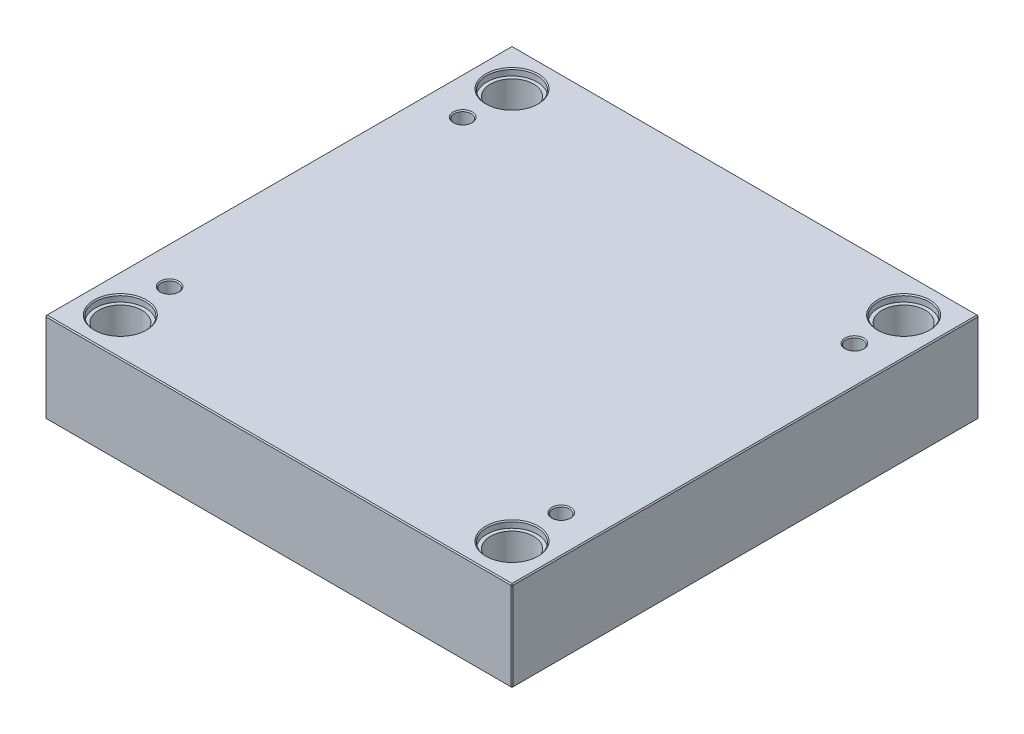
ISO-10303-21;
HEADER;
FILE_DESCRIPTION(('STEP AP214'),'2;1');
FILE_NAME('part.step','',(''),(''),'','','');
FILE_SCHEMA(('AUTOMOTIVE_DESIGN { 1 0 10303 214 1 1 1 1 }'));
ENDSEC;
DATA;
#1=APPLICATION_CONTEXT('core data for automotive mechanical design processes');
#2=APPLICATION_PROTOCOL_DEFINITION('international standard','automotive_design',2000,#1);
#3=PRODUCT_CONTEXT('',#1,'mechanical');
#4=PRODUCT('Part','Part','',(#3));
#5=PRODUCT_RELATED_PRODUCT_CATEGORY('part','',(#4));
#6=PRODUCT_DEFINITION_FORMATION('','',#4);
#7=PRODUCT_DEFINITION_CONTEXT('part definition',#1,'design');
#8=PRODUCT_DEFINITION('design','',#6,#7);
#9=PRODUCT_DEFINITION_SHAPE('','',#8);
#10=(LENGTH_UNIT() NAMED_UNIT(*) SI_UNIT(.MILLI.,.METRE.));
#11=(NAMED_UNIT(*) PLANE_ANGLE_UNIT() SI_UNIT($,.RADIAN.));
#12=(NAMED_UNIT(*) SI_UNIT($,.STERADIAN.) SOLID_ANGLE_UNIT());
#13=UNCERTAINTY_MEASURE_WITH_UNIT(LENGTH_MEASURE(1.E-05),#10,'distance_accuracy_value','');
#14=(GEOMETRIC_REPRESENTATION_CONTEXT(3) GLOBAL_UNCERTAINTY_ASSIGNED_CONTEXT((#13)) GLOBAL_UNIT_ASSIGNED_CONTEXT((#10,
#11,#12)) REPRESENTATION_CONTEXT('',''));
#15=CARTESIAN_POINT('',(0.,0.,0.));
#16=DIRECTION('',(0.,0.,1.));
#17=DIRECTION('',(1.,0.,0.));
#18=AXIS2_PLACEMENT_3D('',#15,#16,#17);
#19=CARTESIAN_POINT('',(-187.,0.,-187.));
#20=DIRECTION('',(0.,1.,0.));
#21=DIRECTION('',(0.,0.,1.));
#22=AXIS2_PLACEMENT_3D('',#19,#20,#21);
#23=CYLINDRICAL_SURFACE('',#22,20.65);
#24=CARTESIAN_POINT('',(-187.,0.99999999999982,-187.));
#25=DIRECTION('',(0.,1.,0.));
#26=DIRECTION('',(0.,0.,1.));
#27=AXIS2_PLACEMENT_3D('',#24,#25,#26);
#28=CIRCLE('',#27,20.65);
#29=CARTESIAN_POINT('',(-187.,0.99999999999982,-166.35));
#30=VERTEX_POINT('',#29);
#31=EDGE_CURVE('E472',#30,#30,#28,.F.);
#32=ORIENTED_EDGE('',*,*,#31,.T.);
#33=EDGE_LOOP('',(#32));
#34=FACE_BOUND('',#33,.T.);
#35=CARTESIAN_POINT('',(-187.,79.7,-187.));
#36=DIRECTION('',(0.,1.,0.));
#37=DIRECTION('',(0.,0.,1.));
#38=AXIS2_PLACEMENT_3D('',#35,#36,#37);
#39=CIRCLE('',#38,20.65);
#40=CARTESIAN_POINT('',(-187.,79.7,-166.35));
#41=VERTEX_POINT('',#40);
#42=EDGE_CURVE('E221',#41,#41,#39,.F.);
#43=ORIENTED_EDGE('',*,*,#42,.F.);
#44=EDGE_LOOP('',(#43));
#45=FACE_BOUND('',#44,.T.);
#46=ADVANCED_FACE('F16',(#34,#45),#23,.F.);
#47=CARTESIAN_POINT('',(187.,0.,-187.));
#48=DIRECTION('',(0.,1.,0.));
#49=DIRECTION('',(0.,0.,1.));
#50=AXIS2_PLACEMENT_3D('',#47,#48,#49);
#51=CYLINDRICAL_SURFACE('',#50,20.65);
#52=CARTESIAN_POINT('',(187.,0.99999999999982,-187.));
#53=DIRECTION('',(0.,1.,0.));
#54=DIRECTION('',(0.,0.,1.));
#55=AXIS2_PLACEMENT_3D('',#52,#53,#54);
#56=CIRCLE('',#55,20.65);
#57=CARTESIAN_POINT('',(187.,0.99999999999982,-166.35));
#58=VERTEX_POINT('',#57);
#59=EDGE_CURVE('E474',#58,#58,#56,.F.);
#60=ORIENTED_EDGE('',*,*,#59,.T.);
#61=EDGE_LOOP('',(#60));
#62=FACE_BOUND('',#61,.T.);
#63=CARTESIAN_POINT('',(187.,79.7,-187.));
#64=DIRECTION('',(0.,1.,0.));
#65=DIRECTION('',(0.,0.,1.));
#66=AXIS2_PLACEMENT_3D('',#63,#64,#65);
#67=CIRCLE('',#66,20.65);
#68=CARTESIAN_POINT('',(187.,79.7,-166.35));
#69=VERTEX_POINT('',#68);
#70=EDGE_CURVE('E218',#69,#69,#67,.F.);
#71=ORIENTED_EDGE('',*,*,#70,.F.);
#72=EDGE_LOOP('',(#71));
#73=FACE_BOUND('',#72,.T.);
#74=ADVANCED_FACE('F263',(#62,#73),#51,.F.);
#75=CARTESIAN_POINT('',(187.,0.,187.));
#76=DIRECTION('',(0.,1.,0.));
#77=DIRECTION('',(0.,0.,1.));
#78=AXIS2_PLACEMENT_3D('',#75,#76,#77);
#79=CYLINDRICAL_SURFACE('',#78,20.65);
#80=CARTESIAN_POINT('',(187.,0.999999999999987,187.));
#81=DIRECTION('',(0.,1.,0.));
#82=DIRECTION('',(0.,0.,1.));
#83=AXIS2_PLACEMENT_3D('',#80,#81,#82);
#84=CIRCLE('',#83,20.65);
#85=CARTESIAN_POINT('',(187.,0.999999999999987,207.65));
#86=VERTEX_POINT('',#85);
#87=EDGE_CURVE('E477',#86,#86,#84,.F.);
#88=ORIENTED_EDGE('',*,*,#87,.T.);
#89=EDGE_LOOP('',(#88));
#90=FACE_BOUND('',#89,.T.);
#91=CARTESIAN_POINT('',(187.,79.7,187.));
#92=DIRECTION('',(0.,1.,0.));
#93=DIRECTION('',(0.,0.,1.));
#94=AXIS2_PLACEMENT_3D('',#91,#92,#93);
#95=CIRCLE('',#94,20.65);
#96=CARTESIAN_POINT('',(187.,79.7,207.65));
#97=VERTEX_POINT('',#96);
#98=EDGE_CURVE('E214',#97,#97,#95,.F.);
#99=ORIENTED_EDGE('',*,*,#98,.F.);
#100=EDGE_LOOP('',(#99));
#101=FACE_BOUND('',#100,.T.);
#102=ADVANCED_FACE('F270',(#90,#101),#79,.F.);
#103=CARTESIAN_POINT('',(-187.,0.,187.));
#104=DIRECTION('',(0.,1.,0.));
#105=DIRECTION('',(0.,0.,1.));
#106=AXIS2_PLACEMENT_3D('',#103,#104,#105);
#107=CYLINDRICAL_SURFACE('',#106,20.65);
#108=CARTESIAN_POINT('',(-187.,0.999999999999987,187.));
#109=DIRECTION('',(0.,1.,0.));
#110=DIRECTION('',(0.,0.,1.));
#111=AXIS2_PLACEMENT_3D('',#108,#109,#110);
#112=CIRCLE('',#111,20.65);
#113=CARTESIAN_POINT('',(-187.,0.999999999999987,207.65));
#114=VERTEX_POINT('',#113);
#115=EDGE_CURVE('E480',#114,#114,#112,.F.);
#116=ORIENTED_EDGE('',*,*,#115,.T.);
#117=EDGE_LOOP('',(#116));
#118=FACE_BOUND('',#117,.T.);
#119=CARTESIAN_POINT('',(-187.,79.7,187.));
#120=DIRECTION('',(0.,1.,0.));
#121=DIRECTION('',(0.,0.,1.));
#122=AXIS2_PLACEMENT_3D('',#119,#120,#121);
#123=CIRCLE('',#122,20.65);
#124=CARTESIAN_POINT('',(-187.,79.7,207.65));
#125=VERTEX_POINT('',#124);
#126=EDGE_CURVE('E211',#125,#125,#123,.F.);
#127=ORIENTED_EDGE('',*,*,#126,.F.);
#128=EDGE_LOOP('',(#127));
#129=FACE_BOUND('',#128,.T.);
#130=ADVANCED_FACE('F277',(#118,#129),#107,.F.);
#131=CARTESIAN_POINT('',(-223.,86.,223.));
#132=DIRECTION('',(1.,0.,0.));
#133=DIRECTION('',(0.,0.,-1.));
#134=AXIS2_PLACEMENT_3D('',#131,#132,#133);
#135=PLANE('',#134);
#136=DIRECTION('',(0.,-1.,0.));
#137=VECTOR('',#136,1.);
#138=CARTESIAN_POINT('',(-223.,86.,-222.));
#139=LINE('',#138,#137);
#140=CARTESIAN_POINT('',(-223.,85.,-222.));
#141=VERTEX_POINT('',#140);
#142=CARTESIAN_POINT('',(-223.,0.99999999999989,-222.));
#143=VERTEX_POINT('',#142);
#144=EDGE_CURVE('E487',#141,#143,#139,.T.);
#145=ORIENTED_EDGE('',*,*,#144,.T.);
#146=DIRECTION('',(0.,0.,1.));
#147=VECTOR('',#146,1.);
#148=CARTESIAN_POINT('',(-223.,0.99999999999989,223.));
#149=LINE('',#148,#147);
#150=CARTESIAN_POINT('',(-223.,0.99999999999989,222.));
#151=VERTEX_POINT('',#150);
#152=EDGE_CURVE('E490',#143,#151,#149,.T.);
#153=ORIENTED_EDGE('',*,*,#152,.T.);
#154=DIRECTION('',(0.,1.,0.));
#155=VECTOR('',#154,1.);
#156=CARTESIAN_POINT('',(-223.,86.,222.));
#157=LINE('',#156,#155);
#158=CARTESIAN_POINT('',(-223.,85.,222.));
#159=VERTEX_POINT('',#158);
#160=EDGE_CURVE('E485',#151,#159,#157,.T.);
#161=ORIENTED_EDGE('',*,*,#160,.T.);
#162=DIRECTION('',(0.,0.,-1.));
#163=VECTOR('',#162,1.);
#164=CARTESIAN_POINT('',(-223.,85.,-223.));
#165=LINE('',#164,#163);
#166=EDGE_CURVE('E483',#159,#141,#165,.T.);
#167=ORIENTED_EDGE('',*,*,#166,.T.);
#168=EDGE_LOOP('',(#145,#153,#161,#167));
#169=FACE_BOUND('',#168,.T.);
#170=ADVANCED_FACE('F298',(#169),#135,.F.);
#171=CARTESIAN_POINT('',(223.,86.,223.));
#172=DIRECTION('',(0.,0.,-1.));
#173=DIRECTION('',(-1.,0.,0.));
#174=AXIS2_PLACEMENT_3D('',#171,#172,#173);
#175=PLANE('',#174);
#176=DIRECTION('',(-1.,0.,0.));
#177=VECTOR('',#176,1.);
#178=CARTESIAN_POINT('',(-223.,85.,223.));
#179=LINE('',#178,#177);
#180=CARTESIAN_POINT('',(222.,85.,223.));
#181=VERTEX_POINT('',#180);
#182=CARTESIAN_POINT('',(-222.,85.,223.));
#183=VERTEX_POINT('',#182);
#184=EDGE_CURVE('E509',#181,#183,#179,.T.);
#185=ORIENTED_EDGE('',*,*,#184,.T.);
#186=DIRECTION('',(0.,-1.,0.));
#187=VECTOR('',#186,1.);
#188=CARTESIAN_POINT('',(-222.,86.,223.));
#189=LINE('',#188,#187);
#190=CARTESIAN_POINT('',(-222.,0.99999999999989,223.));
#191=VERTEX_POINT('',#190);
#192=EDGE_CURVE('E515',#183,#191,#189,.T.);
#193=ORIENTED_EDGE('',*,*,#192,.T.);
#194=DIRECTION('',(1.,0.,0.));
#195=VECTOR('',#194,1.);
#196=CARTESIAN_POINT('',(223.,0.99999999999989,223.));
#197=LINE('',#196,#195);
#198=CARTESIAN_POINT('',(222.,0.99999999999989,223.));
#199=VERTEX_POINT('',#198);
#200=EDGE_CURVE('E513',#191,#199,#197,.T.);
#201=ORIENTED_EDGE('',*,*,#200,.T.);
#202=DIRECTION('',(0.,1.,0.));
#203=VECTOR('',#202,1.);
#204=CARTESIAN_POINT('',(222.,86.,223.));
#205=LINE('',#204,#203);
#206=EDGE_CURVE('E511',#199,#181,#205,.T.);
#207=ORIENTED_EDGE('',*,*,#206,.T.);
#208=EDGE_LOOP('',(#185,#193,#201,#207));
#209=FACE_BOUND('',#208,.T.);
#210=ADVANCED_FACE('F294',(#209),#175,.F.);
#211=CARTESIAN_POINT('',(223.,86.,223.));
#212=DIRECTION('',(-1.,0.,0.));
#213=DIRECTION('',(0.,0.,1.));
#214=AXIS2_PLACEMENT_3D('',#211,#212,#213);
#215=PLANE('',#214);
#216=DIRECTION('',(0.,0.,-1.));
#217=VECTOR('',#216,1.);
#218=CARTESIAN_POINT('',(223.,0.99999999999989,223.));
#219=LINE('',#218,#217);
#220=CARTESIAN_POINT('',(223.,0.99999999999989,222.));
#221=VERTEX_POINT('',#220);
#222=CARTESIAN_POINT('',(223.,0.99999999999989,-222.));
#223=VERTEX_POINT('',#222);
#224=EDGE_CURVE('E504',#221,#223,#219,.T.);
#225=ORIENTED_EDGE('',*,*,#224,.T.);
#226=DIRECTION('',(0.,1.,0.));
#227=VECTOR('',#226,1.);
#228=CARTESIAN_POINT('',(223.,86.,-222.));
#229=LINE('',#228,#227);
#230=CARTESIAN_POINT('',(223.,85.,-222.));
#231=VERTEX_POINT('',#230);
#232=EDGE_CURVE('E506',#223,#231,#229,.T.);
#233=ORIENTED_EDGE('',*,*,#232,.T.);
#234=DIRECTION('',(0.,0.,1.));
#235=VECTOR('',#234,1.);
#236=CARTESIAN_POINT('',(223.,85.,223.));
#237=LINE('',#236,#235);
#238=CARTESIAN_POINT('',(223.,85.,222.));
#239=VERTEX_POINT('',#238);
#240=EDGE_CURVE('E500',#231,#239,#237,.T.);
#241=ORIENTED_EDGE('',*,*,#240,.T.);
#242=DIRECTION('',(0.,-1.,0.));
#243=VECTOR('',#242,1.);
#244=CARTESIAN_POINT('',(223.,86.,222.));
#245=LINE('',#244,#243);
#246=EDGE_CURVE('E502',#239,#221,#245,.T.);
#247=ORIENTED_EDGE('',*,*,#246,.T.);
#248=EDGE_LOOP('',(#225,#233,#241,#247));
#249=FACE_BOUND('',#248,.T.);
#250=ADVANCED_FACE('F290',(#249),#215,.F.);
#251=CARTESIAN_POINT('',(223.,86.,-223.));
#252=DIRECTION('',(0.,0.,1.));
#253=DIRECTION('',(1.,0.,0.));
#254=AXIS2_PLACEMENT_3D('',#251,#252,#253);
#255=PLANE('',#254);
#256=DIRECTION('',(0.,-1.,0.));
#257=VECTOR('',#256,1.);
#258=CARTESIAN_POINT('',(222.,86.,-223.));
#259=LINE('',#258,#257);
#260=CARTESIAN_POINT('',(222.,85.,-223.));
#261=VERTEX_POINT('',#260);
#262=CARTESIAN_POINT('',(222.,0.99999999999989,-223.));
#263=VERTEX_POINT('',#262);
#264=EDGE_CURVE('E494',#261,#263,#259,.T.);
#265=ORIENTED_EDGE('',*,*,#264,.T.);
#266=DIRECTION('',(-1.,0.,0.));
#267=VECTOR('',#266,1.);
#268=CARTESIAN_POINT('',(223.,0.99999999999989,-223.));
#269=LINE('',#268,#267);
#270=CARTESIAN_POINT('',(-222.,0.99999999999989,-223.));
#271=VERTEX_POINT('',#270);
#272=EDGE_CURVE('E138',#263,#271,#269,.T.);
#273=ORIENTED_EDGE('',*,*,#272,.T.);
#274=DIRECTION('',(0.,1.,0.));
#275=VECTOR('',#274,1.);
#276=CARTESIAN_POINT('',(-222.,86.,-223.));
#277=LINE('',#276,#275);
#278=CARTESIAN_POINT('',(-222.,85.,-223.));
#279=VERTEX_POINT('',#278);
#280=EDGE_CURVE('E496',#271,#279,#277,.T.);
#281=ORIENTED_EDGE('',*,*,#280,.T.);
#282=DIRECTION('',(1.,0.,0.));
#283=VECTOR('',#282,1.);
#284=CARTESIAN_POINT('',(223.,85.,-223.));
#285=LINE('',#284,#283);
#286=EDGE_CURVE('E492',#279,#261,#285,.T.);
#287=ORIENTED_EDGE('',*,*,#286,.T.);
#288=EDGE_LOOP('',(#265,#273,#281,#287));
#289=FACE_BOUND('',#288,.T.);
#290=ADVANCED_FACE('F282',(#289),#255,.F.);
#291=CARTESIAN_POINT('',(0.,86.,0.));
#292=DIRECTION('',(0.,1.,0.));
#293=DIRECTION('',(0.,0.,1.));
#294=AXIS2_PLACEMENT_3D('',#291,#292,#293);
#295=PLANE('',#294);
#296=CARTESIAN_POINT('',(187.,86.,187.));
#297=DIRECTION('',(0.,1.,0.));
#298=DIRECTION('',(0.,0.,1.));
#299=AXIS2_PLACEMENT_3D('',#296,#297,#298);
#300=CIRCLE('',#299,25.);
#301=CARTESIAN_POINT('',(187.,86.,212.));
#302=VERTEX_POINT('',#301);
#303=EDGE_CURVE('E236',#302,#302,#300,.F.);
#304=ORIENTED_EDGE('',*,*,#303,.T.);
#305=EDGE_LOOP('',(#304));
#306=FACE_BOUND('',#305,.T.);
#307=CARTESIAN_POINT('',(-187.,86.,187.));
#308=DIRECTION('',(0.,1.,0.));
#309=DIRECTION('',(0.,0.,1.));
#310=AXIS2_PLACEMENT_3D('',#307,#308,#309);
#311=CIRCLE('',#310,25.);
#312=CARTESIAN_POINT('',(-187.,86.,212.));
#313=VERTEX_POINT('',#312);
#314=EDGE_CURVE('E233',#313,#313,#311,.F.);
#315=ORIENTED_EDGE('',*,*,#314,.T.);
#316=EDGE_LOOP('',(#315));
#317=FACE_BOUND('',#316,.T.);
#318=CARTESIAN_POINT('',(187.,86.,-187.));
#319=DIRECTION('',(0.,1.,0.));
#320=DIRECTION('',(0.,0.,1.));
#321=AXIS2_PLACEMENT_3D('',#318,#319,#320);
#322=CIRCLE('',#321,25.);
#323=CARTESIAN_POINT('',(187.,86.,-162.));
#324=VERTEX_POINT('',#323);
#325=EDGE_CURVE('E230',#324,#324,#322,.F.);
#326=ORIENTED_EDGE('',*,*,#325,.T.);
#327=EDGE_LOOP('',(#326));
#328=FACE_BOUND('',#327,.T.);
#329=CARTESIAN_POINT('',(-187.,86.,-187.));
#330=DIRECTION('',(0.,1.,0.));
#331=DIRECTION('',(0.,0.,1.));
#332=AXIS2_PLACEMENT_3D('',#329,#330,#331);
#333=CIRCLE('',#332,25.);
#334=CARTESIAN_POINT('',(-187.,86.,-162.));
#335=VERTEX_POINT('',#334);
#336=EDGE_CURVE('E227',#335,#335,#333,.F.);
#337=ORIENTED_EDGE('',*,*,#336,.T.);
#338=EDGE_LOOP('',(#337));
#339=FACE_BOUND('',#338,.T.);
#340=CARTESIAN_POINT('',(-187.,86.,140.));
#341=DIRECTION('',(0.,1.,0.));
#342=DIRECTION('',(0.,0.,1.));
#343=AXIS2_PLACEMENT_3D('',#340,#341,#342);
#344=CIRCLE('',#343,8.99999999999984);
#345=CARTESIAN_POINT('',(-187.,86.,149.));
#346=VERTEX_POINT('',#345);
#347=EDGE_CURVE('E198',#346,#346,#344,.F.);
#348=ORIENTED_EDGE('',*,*,#347,.T.);
#349=EDGE_LOOP('',(#348));
#350=FACE_BOUND('',#349,.T.);
#351=CARTESIAN_POINT('',(187.,86.,140.));
#352=DIRECTION('',(0.,1.,0.));
#353=DIRECTION('',(0.,0.,1.));
#354=AXIS2_PLACEMENT_3D('',#351,#352,#353);
#355=CIRCLE('',#354,9.);
#356=CARTESIAN_POINT('',(187.,86.,149.));
#357=VERTEX_POINT('',#356);
#358=EDGE_CURVE('E195',#357,#357,#355,.F.);
#359=ORIENTED_EDGE('',*,*,#358,.T.);
#360=EDGE_LOOP('',(#359));
#361=FACE_BOUND('',#360,.T.);
#362=CARTESIAN_POINT('',(187.,86.,-140.));
#363=DIRECTION('',(0.,1.,0.));
#364=DIRECTION('',(0.,0.,1.));
#365=AXIS2_PLACEMENT_3D('',#362,#363,#364);
#366=CIRCLE('',#365,9.);
#367=CARTESIAN_POINT('',(187.,86.,-131.));
#368=VERTEX_POINT('',#367);
#369=EDGE_CURVE('E192',#368,#368,#366,.F.);
#370=ORIENTED_EDGE('',*,*,#369,.T.);
#371=EDGE_LOOP('',(#370));
#372=FACE_BOUND('',#371,.T.);
#373=CARTESIAN_POINT('',(-187.,86.,-140.));
#374=DIRECTION('',(0.,1.,0.));
#375=DIRECTION('',(0.,0.,1.));
#376=AXIS2_PLACEMENT_3D('',#373,#374,#375);
#377=CIRCLE('',#376,8.99999999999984);
#378=CARTESIAN_POINT('',(-187.,86.,-131.));
#379=VERTEX_POINT('',#378);
#380=EDGE_CURVE('E188',#379,#379,#377,.F.);
#381=ORIENTED_EDGE('',*,*,#380,.T.);
#382=EDGE_LOOP('',(#381));
#383=FACE_BOUND('',#382,.T.);
#384=DIRECTION('',(0.,0.,-1.));
#385=VECTOR('',#384,1.);
#386=CARTESIAN_POINT('',(222.,86.,-223.));
#387=LINE('',#386,#385);
#388=CARTESIAN_POINT('',(222.,86.,222.));
#389=VERTEX_POINT('',#388);
#390=CARTESIAN_POINT('',(222.,86.,-222.));
#391=VERTEX_POINT('',#390);
#392=EDGE_CURVE('E31',#389,#391,#387,.T.);
#393=ORIENTED_EDGE('',*,*,#392,.T.);
#394=DIRECTION('',(-1.,0.,0.));
#395=VECTOR('',#394,1.);
#396=CARTESIAN_POINT('',(-223.,86.,-222.));
#397=LINE('',#396,#395);
#398=CARTESIAN_POINT('',(-222.,86.,-222.));
#399=VERTEX_POINT('',#398);
#400=EDGE_CURVE('E189',#391,#399,#397,.T.);
#401=ORIENTED_EDGE('',*,*,#400,.T.);
#402=DIRECTION('',(0.,0.,1.));
#403=VECTOR('',#402,1.);
#404=CARTESIAN_POINT('',(-222.,86.,223.));
#405=LINE('',#404,#403);
#406=CARTESIAN_POINT('',(-222.,86.,222.));
#407=VERTEX_POINT('',#406);
#408=EDGE_CURVE('E518',#399,#407,#405,.T.);
#409=ORIENTED_EDGE('',*,*,#408,.T.);
#410=DIRECTION('',(1.,0.,0.));
#411=VECTOR('',#410,1.);
#412=CARTESIAN_POINT('',(223.,86.,222.));
#413=LINE('',#412,#411);
#414=EDGE_CURVE('E36',#407,#389,#413,.T.);
#415=ORIENTED_EDGE('',*,*,#414,.T.);
#416=EDGE_LOOP('',(#393,#401,#409,#415));
#417=FACE_BOUND('',#416,.T.);
#418=ADVANCED_FACE('F279',(#306,#317,#328,#339,#350,#361,#372,#383,#417),#295,.T.);
#419=CARTESIAN_POINT('',(0.,0.,0.));
#420=DIRECTION('',(0.,1.,0.));
#421=DIRECTION('',(0.,0.,1.));
#422=AXIS2_PLACEMENT_3D('',#419,#420,#421);
#423=PLANE('',#422);
#424=CARTESIAN_POINT('',(-187.,0.,-187.));
#425=DIRECTION('',(0.,1.,0.));
#426=DIRECTION('',(0.,0.,1.));
#427=AXIS2_PLACEMENT_3D('',#424,#425,#426);
#428=CIRCLE('',#427,21.65);
#429=CARTESIAN_POINT('',(-187.,0.,-165.35));
#430=VERTEX_POINT('',#429);
#431=EDGE_CURVE('E469',#430,#430,#428,.T.);
#432=ORIENTED_EDGE('',*,*,#431,.T.);
#433=EDGE_LOOP('',(#432));
#434=FACE_BOUND('',#433,.T.);
#435=CARTESIAN_POINT('',(187.,0.,-187.));
#436=DIRECTION('',(0.,1.,0.));
#437=DIRECTION('',(0.,0.,1.));
#438=AXIS2_PLACEMENT_3D('',#435,#436,#437);
#439=CIRCLE('',#438,21.65);
#440=CARTESIAN_POINT('',(187.,0.,-165.35));
#441=VERTEX_POINT('',#440);
#442=EDGE_CURVE('E466',#441,#441,#439,.T.);
#443=ORIENTED_EDGE('',*,*,#442,.T.);
#444=EDGE_LOOP('',(#443));
#445=FACE_BOUND('',#444,.T.);
#446=CARTESIAN_POINT('',(187.,0.,187.));
#447=DIRECTION('',(0.,1.,0.));
#448=DIRECTION('',(0.,0.,1.));
#449=AXIS2_PLACEMENT_3D('',#446,#447,#448);
#450=CIRCLE('',#449,21.65);
#451=CARTESIAN_POINT('',(187.,0.,208.65));
#452=VERTEX_POINT('',#451);
#453=EDGE_CURVE('E463',#452,#452,#450,.T.);
#454=ORIENTED_EDGE('',*,*,#453,.T.);
#455=EDGE_LOOP('',(#454));
#456=FACE_BOUND('',#455,.T.);
#457=CARTESIAN_POINT('',(-187.,0.,187.));
#458=DIRECTION('',(0.,1.,0.));
#459=DIRECTION('',(0.,0.,1.));
#460=AXIS2_PLACEMENT_3D('',#457,#458,#459);
#461=CIRCLE('',#460,21.65);
#462=CARTESIAN_POINT('',(-187.,0.,208.65));
#463=VERTEX_POINT('',#462);
#464=EDGE_CURVE('E460',#463,#463,#461,.T.);
#465=ORIENTED_EDGE('',*,*,#464,.T.);
#466=EDGE_LOOP('',(#465));
#467=FACE_BOUND('',#466,.T.);
#468=DIRECTION('',(0.,0.,1.));
#469=VECTOR('',#468,1.);
#470=CARTESIAN_POINT('',(222.,0.,0.));
#471=LINE('',#470,#469);
#472=CARTESIAN_POINT('',(222.,0.,-222.));
#473=VERTEX_POINT('',#472);
#474=CARTESIAN_POINT('',(222.,0.,222.));
#475=VERTEX_POINT('',#474);
#476=EDGE_CURVE('E108',#473,#475,#471,.T.);
#477=ORIENTED_EDGE('',*,*,#476,.T.);
#478=DIRECTION('',(-1.,0.,0.));
#479=VECTOR('',#478,1.);
#480=CARTESIAN_POINT('',(0.,0.,222.));
#481=LINE('',#480,#479);
#482=CARTESIAN_POINT('',(-222.,0.,222.));
#483=VERTEX_POINT('',#482);
#484=EDGE_CURVE('E458',#475,#483,#481,.T.);
#485=ORIENTED_EDGE('',*,*,#484,.T.);
#486=DIRECTION('',(0.,0.,-1.));
#487=VECTOR('',#486,1.);
#488=CARTESIAN_POINT('',(-222.,0.,0.));
#489=LINE('',#488,#487);
#490=CARTESIAN_POINT('',(-222.,0.,-222.));
#491=VERTEX_POINT('',#490);
#492=EDGE_CURVE('E110',#483,#491,#489,.T.);
#493=ORIENTED_EDGE('',*,*,#492,.T.);
#494=DIRECTION('',(1.,0.,0.));
#495=VECTOR('',#494,1.);
#496=CARTESIAN_POINT('',(0.,0.,-222.));
#497=LINE('',#496,#495);
#498=EDGE_CURVE('E104',#491,#473,#497,.T.);
#499=ORIENTED_EDGE('',*,*,#498,.T.);
#500=EDGE_LOOP('',(#477,#485,#493,#499));
#501=FACE_BOUND('',#500,.T.);
#502=ADVANCED_FACE('F106',(#434,#445,#456,#467,#501),#423,.F.);
#503=CARTESIAN_POINT('',(-187.,0.,-187.));
#504=DIRECTION('',(0.,-1.,0.));
#505=DIRECTION('',(0.,0.,-1.));
#506=AXIS2_PLACEMENT_3D('',#503,#504,#505);
#507=CONICAL_SURFACE('',#506,21.65,0.785398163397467);
#508=ORIENTED_EDGE('',*,*,#31,.F.);
#509=EDGE_LOOP('',(#508));
#510=FACE_BOUND('',#509,.T.);
#511=ORIENTED_EDGE('',*,*,#431,.F.);
#512=EDGE_LOOP('',(#511));
#513=FACE_BOUND('',#512,.T.);
#514=ADVANCED_FACE('F286',(#510,#513),#507,.F.);
#515=CARTESIAN_POINT('',(187.,0.,-187.));
#516=DIRECTION('',(0.,-1.,0.));
#517=DIRECTION('',(0.,0.,-1.));
#518=AXIS2_PLACEMENT_3D('',#515,#516,#517);
#519=CONICAL_SURFACE('',#518,21.65,0.785398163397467);
#520=ORIENTED_EDGE('',*,*,#59,.F.);
#521=EDGE_LOOP('',(#520));
#522=FACE_BOUND('',#521,.T.);
#523=ORIENTED_EDGE('',*,*,#442,.F.);
#524=EDGE_LOOP('',(#523));
#525=FACE_BOUND('',#524,.T.);
#526=ADVANCED_FACE('F305',(#522,#525),#519,.F.);
#527=CARTESIAN_POINT('',(187.,0.,187.));
#528=DIRECTION('',(0.,-1.,0.));
#529=DIRECTION('',(0.,0.,-1.));
#530=AXIS2_PLACEMENT_3D('',#527,#528,#529);
#531=CONICAL_SURFACE('',#530,21.65,0.785398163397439);
#532=ORIENTED_EDGE('',*,*,#87,.F.);
#533=EDGE_LOOP('',(#532));
#534=FACE_BOUND('',#533,.T.);
#535=ORIENTED_EDGE('',*,*,#453,.F.);
#536=EDGE_LOOP('',(#535));
#537=FACE_BOUND('',#536,.T.);
#538=ADVANCED_FACE('F309',(#534,#537),#531,.F.);
#539=CARTESIAN_POINT('',(-187.,0.,187.));
#540=DIRECTION('',(0.,-1.,0.));
#541=DIRECTION('',(0.,0.,-1.));
#542=AXIS2_PLACEMENT_3D('',#539,#540,#541);
#543=CONICAL_SURFACE('',#542,21.65,0.785398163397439);
#544=ORIENTED_EDGE('',*,*,#115,.F.);
#545=EDGE_LOOP('',(#544));
#546=FACE_BOUND('',#545,.T.);
#547=ORIENTED_EDGE('',*,*,#464,.F.);
#548=EDGE_LOOP('',(#547));
#549=FACE_BOUND('',#548,.T.);
#550=ADVANCED_FACE('F313',(#546,#549),#543,.F.);
#551=CARTESIAN_POINT('',(223.,86.,222.));
#552=DIRECTION('',(-0.707106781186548,0.,-0.707106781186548));
#553=DIRECTION('',(0.,-1.,0.));
#554=AXIS2_PLACEMENT_3D('',#551,#552,#553);
#555=PLANE('',#554);
#556=DIRECTION('',(-0.707106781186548,0.,0.707106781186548));
#557=VECTOR('',#556,1.);
#558=CARTESIAN_POINT('',(222.,85.,223.));
#559=LINE('',#558,#557);
#560=EDGE_CURVE('E126',#181,#239,#559,.F.);
#561=ORIENTED_EDGE('',*,*,#560,.F.);
#562=ORIENTED_EDGE('',*,*,#206,.F.);
#563=DIRECTION('',(0.707106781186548,0.,-0.707106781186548));
#564=VECTOR('',#563,1.);
#565=CARTESIAN_POINT('',(222.,0.99999999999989,223.));
#566=LINE('',#565,#564);
#567=EDGE_CURVE('E180',#221,#199,#566,.F.);
#568=ORIENTED_EDGE('',*,*,#567,.F.);
#569=ORIENTED_EDGE('',*,*,#246,.F.);
#570=EDGE_LOOP('',(#561,#562,#568,#569));
#571=FACE_BOUND('',#570,.T.);
#572=ADVANCED_FACE('F317',(#571),#555,.F.);
#573=CARTESIAN_POINT('',(222.,85.,223.));
#574=DIRECTION('',(0.577350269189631,0.577350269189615,0.577350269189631));
#575=DIRECTION('',(0.707106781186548,0.,-0.707106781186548));
#576=AXIS2_PLACEMENT_3D('',#573,#574,#575);
#577=PLANE('',#576);
#578=DIRECTION('',(0.,-0.707106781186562,0.707106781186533));
#579=VECTOR('',#578,1.);
#580=CARTESIAN_POINT('',(222.,85.,223.));
#581=LINE('',#580,#579);
#582=EDGE_CURVE('E175',#181,#389,#581,.F.);
#583=ORIENTED_EDGE('',*,*,#582,.F.);
#584=ORIENTED_EDGE('',*,*,#560,.T.);
#585=DIRECTION('',(-0.707106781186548,0.707106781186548,0.));
#586=VECTOR('',#585,1.);
#587=CARTESIAN_POINT('',(222.5,85.5,222.));
#588=LINE('',#587,#586);
#589=EDGE_CURVE('E177',#389,#239,#588,.F.);
#590=ORIENTED_EDGE('',*,*,#589,.F.);
#591=EDGE_LOOP('',(#583,#584,#590));
#592=FACE_BOUND('',#591,.T.);
#593=ADVANCED_FACE('F385',(#592),#577,.T.);
#594=CARTESIAN_POINT('',(222.,0.99999999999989,223.));
#595=DIRECTION('',(0.577350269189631,-0.577350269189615,0.577350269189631));
#596=DIRECTION('',(0.707106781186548,0.,-0.707106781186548));
#597=AXIS2_PLACEMENT_3D('',#594,#595,#596);
#598=PLANE('',#597);
#599=DIRECTION('',(-0.707106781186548,-0.707106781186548,0.));
#600=VECTOR('',#599,1.);
#601=CARTESIAN_POINT('',(222.5,0.499999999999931,222.));
#602=LINE('',#601,#600);
#603=EDGE_CURVE('E124',#221,#475,#602,.T.);
#604=ORIENTED_EDGE('',*,*,#603,.F.);
#605=ORIENTED_EDGE('',*,*,#567,.T.);
#606=DIRECTION('',(0.,0.707106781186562,0.707106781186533));
#607=VECTOR('',#606,1.);
#608=CARTESIAN_POINT('',(222.,0.99999999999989,223.));
#609=LINE('',#608,#607);
#610=EDGE_CURVE('E172',#475,#199,#609,.T.);
#611=ORIENTED_EDGE('',*,*,#610,.F.);
#612=EDGE_LOOP('',(#604,#605,#611));
#613=FACE_BOUND('',#612,.T.);
#614=ADVANCED_FACE('F381',(#613),#598,.T.);
#615=CARTESIAN_POINT('',(222.,86.,0.));
#616=DIRECTION('',(0.707106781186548,0.707106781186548,0.));
#617=DIRECTION('',(0.,0.,1.));
#618=AXIS2_PLACEMENT_3D('',#615,#616,#617);
#619=PLANE('',#618);
#620=ORIENTED_EDGE('',*,*,#589,.T.);
#621=ORIENTED_EDGE('',*,*,#240,.F.);
#622=DIRECTION('',(0.707106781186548,-0.707106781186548,0.));
#623=VECTOR('',#622,1.);
#624=CARTESIAN_POINT('',(223.,85.,-222.));
#625=LINE('',#624,#623);
#626=EDGE_CURVE('E166',#391,#231,#625,.T.);
#627=ORIENTED_EDGE('',*,*,#626,.F.);
#628=ORIENTED_EDGE('',*,*,#392,.F.);
#629=EDGE_LOOP('',(#620,#621,#627,#628));
#630=FACE_BOUND('',#629,.T.);
#631=ADVANCED_FACE('F377',(#630),#619,.T.);
#632=CARTESIAN_POINT('',(0.,86.,222.));
#633=DIRECTION('',(0.,0.707106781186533,0.707106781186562));
#634=DIRECTION('',(-1.,0.,0.));
#635=AXIS2_PLACEMENT_3D('',#632,#633,#634);
#636=PLANE('',#635);
#637=ORIENTED_EDGE('',*,*,#582,.T.);
#638=ORIENTED_EDGE('',*,*,#414,.F.);
#639=DIRECTION('',(0.,0.707106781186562,-0.707106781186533));
#640=VECTOR('',#639,1.);
#641=CARTESIAN_POINT('',(-222.,85.5,222.5));
#642=LINE('',#641,#640);
#643=EDGE_CURVE('E163',#183,#407,#642,.T.);
#644=ORIENTED_EDGE('',*,*,#643,.F.);
#645=ORIENTED_EDGE('',*,*,#184,.F.);
#646=EDGE_LOOP('',(#637,#638,#644,#645));
#647=FACE_BOUND('',#646,.T.);
#648=ADVANCED_FACE('F373',(#647),#636,.T.);
#649=CARTESIAN_POINT('',(-222.,86.,223.));
#650=DIRECTION('',(0.707106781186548,0.,-0.707106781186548));
#651=DIRECTION('',(0.,-1.,0.));
#652=AXIS2_PLACEMENT_3D('',#649,#650,#651);
#653=PLANE('',#652);
#654=DIRECTION('',(0.707106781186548,0.,0.707106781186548));
#655=VECTOR('',#654,1.);
#656=CARTESIAN_POINT('',(-222.,0.99999999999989,223.));
#657=LINE('',#656,#655);
#658=EDGE_CURVE('E157',#191,#151,#657,.F.);
#659=ORIENTED_EDGE('',*,*,#658,.F.);
#660=ORIENTED_EDGE('',*,*,#192,.F.);
#661=DIRECTION('',(-0.707106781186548,0.,-0.707106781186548));
#662=VECTOR('',#661,1.);
#663=CARTESIAN_POINT('',(-223.,85.,222.));
#664=LINE('',#663,#662);
#665=EDGE_CURVE('E160',#159,#183,#664,.F.);
#666=ORIENTED_EDGE('',*,*,#665,.F.);
#667=ORIENTED_EDGE('',*,*,#160,.F.);
#668=EDGE_LOOP('',(#659,#660,#666,#667));
#669=FACE_BOUND('',#668,.T.);
#670=ADVANCED_FACE('F369',(#669),#653,.F.);
#671=CARTESIAN_POINT('',(223.,0.99999999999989,223.));
#672=DIRECTION('',(0.,0.707106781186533,-0.707106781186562));
#673=DIRECTION('',(1.,0.,0.));
#674=AXIS2_PLACEMENT_3D('',#671,#672,#673);
#675=PLANE('',#674);
#676=ORIENTED_EDGE('',*,*,#610,.T.);
#677=ORIENTED_EDGE('',*,*,#200,.F.);
#678=DIRECTION('',(0.,-0.707106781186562,-0.707106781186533));
#679=VECTOR('',#678,1.);
#680=CARTESIAN_POINT('',(-222.,0.99999999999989,223.));
#681=LINE('',#680,#679);
#682=EDGE_CURVE('E135',#483,#191,#681,.F.);
#683=ORIENTED_EDGE('',*,*,#682,.F.);
#684=ORIENTED_EDGE('',*,*,#484,.F.);
#685=EDGE_LOOP('',(#676,#677,#683,#684));
#686=FACE_BOUND('',#685,.T.);
#687=ADVANCED_FACE('F366',(#686),#675,.F.);
#688=CARTESIAN_POINT('',(223.,0.99999999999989,223.));
#689=DIRECTION('',(-0.707106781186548,0.707106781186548,0.));
#690=DIRECTION('',(0.,0.,-1.));
#691=AXIS2_PLACEMENT_3D('',#688,#689,#690);
#692=PLANE('',#691);
#693=ORIENTED_EDGE('',*,*,#603,.T.);
#694=ORIENTED_EDGE('',*,*,#476,.F.);
#695=DIRECTION('',(0.707106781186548,0.707106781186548,0.));
#696=VECTOR('',#695,1.);
#697=CARTESIAN_POINT('',(222.5,0.499999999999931,-222.));
#698=LINE('',#697,#696);
#699=EDGE_CURVE('E121',#223,#473,#698,.F.);
#700=ORIENTED_EDGE('',*,*,#699,.F.);
#701=ORIENTED_EDGE('',*,*,#224,.F.);
#702=EDGE_LOOP('',(#693,#694,#700,#701));
#703=FACE_BOUND('',#702,.T.);
#704=ADVANCED_FACE('F119',(#703),#692,.F.);
#705=CARTESIAN_POINT('',(222.,86.,-223.));
#706=DIRECTION('',(-0.707106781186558,0.,0.707106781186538));
#707=DIRECTION('',(0.,-1.,0.));
#708=AXIS2_PLACEMENT_3D('',#705,#706,#707);
#709=PLANE('',#708);
#710=DIRECTION('',(0.707106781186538,0.,0.707106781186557));
#711=VECTOR('',#710,1.);
#712=CARTESIAN_POINT('',(223.,85.,-222.));
#713=LINE('',#712,#711);
#714=EDGE_CURVE('E168',#231,#261,#713,.F.);
#715=ORIENTED_EDGE('',*,*,#714,.F.);
#716=ORIENTED_EDGE('',*,*,#232,.F.);
#717=DIRECTION('',(-0.707106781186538,0.,-0.707106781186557));
#718=VECTOR('',#717,1.);
#719=CARTESIAN_POINT('',(222.,0.99999999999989,-223.));
#720=LINE('',#719,#718);
#721=EDGE_CURVE('E134',#263,#223,#720,.F.);
#722=ORIENTED_EDGE('',*,*,#721,.F.);
#723=ORIENTED_EDGE('',*,*,#264,.F.);
#724=EDGE_LOOP('',(#715,#716,#722,#723));
#725=FACE_BOUND('',#724,.T.);
#726=ADVANCED_FACE('F359',(#725),#709,.F.);
#727=CARTESIAN_POINT('',(223.,85.,-222.));
#728=DIRECTION('',(0.577350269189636,0.57735026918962,-0.57735026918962));
#729=DIRECTION('',(-0.707106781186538,0.,-0.707106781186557));
#730=AXIS2_PLACEMENT_3D('',#727,#728,#729);
#731=PLANE('',#730);
#732=ORIENTED_EDGE('',*,*,#626,.T.);
#733=ORIENTED_EDGE('',*,*,#714,.T.);
#734=DIRECTION('',(0.,0.707106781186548,0.707106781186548));
#735=VECTOR('',#734,1.);
#736=CARTESIAN_POINT('',(222.,85.5,-222.5));
#737=LINE('',#736,#735);
#738=EDGE_CURVE('E152',#391,#261,#737,.F.);
#739=ORIENTED_EDGE('',*,*,#738,.F.);
#740=EDGE_LOOP('',(#732,#733,#739));
#741=FACE_BOUND('',#740,.T.);
#742=ADVANCED_FACE('F355',(#741),#731,.T.);
#743=CARTESIAN_POINT('',(-223.,85.,222.));
#744=DIRECTION('',(-0.577350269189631,0.577350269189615,0.577350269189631));
#745=DIRECTION('',(0.707106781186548,0.,0.707106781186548));
#746=AXIS2_PLACEMENT_3D('',#743,#744,#745);
#747=PLANE('',#746);
#748=ORIENTED_EDGE('',*,*,#665,.T.);
#749=ORIENTED_EDGE('',*,*,#643,.T.);
#750=DIRECTION('',(-0.707106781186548,-0.707106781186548,0.));
#751=VECTOR('',#750,1.);
#752=CARTESIAN_POINT('',(-223.,85.,222.));
#753=LINE('',#752,#751);
#754=EDGE_CURVE('E143',#159,#407,#753,.F.);
#755=ORIENTED_EDGE('',*,*,#754,.F.);
#756=EDGE_LOOP('',(#748,#749,#755));
#757=FACE_BOUND('',#756,.T.);
#758=ADVANCED_FACE('F351',(#757),#747,.T.);
#759=CARTESIAN_POINT('',(-222.,0.99999999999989,223.));
#760=DIRECTION('',(-0.577350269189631,-0.577350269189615,0.577350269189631));
#761=DIRECTION('',(0.707106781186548,0.,0.707106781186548));
#762=AXIS2_PLACEMENT_3D('',#759,#760,#761);
#763=PLANE('',#762);
#764=ORIENTED_EDGE('',*,*,#682,.T.);
#765=ORIENTED_EDGE('',*,*,#658,.T.);
#766=DIRECTION('',(-0.707106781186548,0.707106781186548,0.));
#767=VECTOR('',#766,1.);
#768=CARTESIAN_POINT('',(-222.5,0.499999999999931,222.));
#769=LINE('',#768,#767);
#770=EDGE_CURVE('E139',#483,#151,#769,.T.);
#771=ORIENTED_EDGE('',*,*,#770,.F.);
#772=EDGE_LOOP('',(#764,#765,#771));
#773=FACE_BOUND('',#772,.T.);
#774=ADVANCED_FACE('F348',(#773),#763,.T.);
#775=CARTESIAN_POINT('',(222.,0.99999999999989,-223.));
#776=DIRECTION('',(0.577350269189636,-0.57735026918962,-0.57735026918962));
#777=DIRECTION('',(-0.707106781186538,0.,-0.707106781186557));
#778=AXIS2_PLACEMENT_3D('',#775,#776,#777);
#779=PLANE('',#778);
#780=ORIENTED_EDGE('',*,*,#721,.T.);
#781=ORIENTED_EDGE('',*,*,#699,.T.);
#782=DIRECTION('',(0.,-0.707106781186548,0.707106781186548));
#783=VECTOR('',#782,1.);
#784=CARTESIAN_POINT('',(222.,0.99999999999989,-223.));
#785=LINE('',#784,#783);
#786=EDGE_CURVE('E131',#263,#473,#785,.T.);
#787=ORIENTED_EDGE('',*,*,#786,.F.);
#788=EDGE_LOOP('',(#780,#781,#787));
#789=FACE_BOUND('',#788,.T.);
#790=ADVANCED_FACE('F130',(#789),#779,.T.);
#791=CARTESIAN_POINT('',(0.,86.,-222.));
#792=DIRECTION('',(0.,0.707106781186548,-0.707106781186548));
#793=DIRECTION('',(1.,0.,0.));
#794=AXIS2_PLACEMENT_3D('',#791,#792,#793);
#795=PLANE('',#794);
#796=ORIENTED_EDGE('',*,*,#738,.T.);
#797=ORIENTED_EDGE('',*,*,#286,.F.);
#798=DIRECTION('',(0.,-0.707106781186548,-0.707106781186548));
#799=VECTOR('',#798,1.);
#800=CARTESIAN_POINT('',(-222.,85.,-223.));
#801=LINE('',#800,#799);
#802=EDGE_CURVE('E140',#399,#279,#801,.T.);
#803=ORIENTED_EDGE('',*,*,#802,.F.);
#804=ORIENTED_EDGE('',*,*,#400,.F.);
#805=EDGE_LOOP('',(#796,#797,#803,#804));
#806=FACE_BOUND('',#805,.T.);
#807=ADVANCED_FACE('F341',(#806),#795,.T.);
#808=CARTESIAN_POINT('',(-222.,86.,0.));
#809=DIRECTION('',(-0.707106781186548,0.707106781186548,0.));
#810=DIRECTION('',(0.,0.,-1.));
#811=AXIS2_PLACEMENT_3D('',#808,#809,#810);
#812=PLANE('',#811);
#813=ORIENTED_EDGE('',*,*,#754,.T.);
#814=ORIENTED_EDGE('',*,*,#408,.F.);
#815=DIRECTION('',(0.707106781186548,0.707106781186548,0.));
#816=VECTOR('',#815,1.);
#817=CARTESIAN_POINT('',(-222.5,85.5,-222.));
#818=LINE('',#817,#816);
#819=EDGE_CURVE('E146',#141,#399,#818,.T.);
#820=ORIENTED_EDGE('',*,*,#819,.F.);
#821=ORIENTED_EDGE('',*,*,#166,.F.);
#822=EDGE_LOOP('',(#813,#814,#820,#821));
#823=FACE_BOUND('',#822,.T.);
#824=ADVANCED_FACE('F337',(#823),#812,.T.);
#825=CARTESIAN_POINT('',(-223.,0.99999999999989,223.));
#826=DIRECTION('',(0.707106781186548,0.707106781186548,0.));
#827=DIRECTION('',(0.,0.,1.));
#828=AXIS2_PLACEMENT_3D('',#825,#826,#827);
#829=PLANE('',#828);
#830=ORIENTED_EDGE('',*,*,#770,.T.);
#831=ORIENTED_EDGE('',*,*,#152,.F.);
#832=DIRECTION('',(0.707106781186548,-0.707106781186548,0.));
#833=VECTOR('',#832,1.);
#834=CARTESIAN_POINT('',(-223.,0.99999999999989,-222.));
#835=LINE('',#834,#833);
#836=EDGE_CURVE('E529',#491,#143,#835,.F.);
#837=ORIENTED_EDGE('',*,*,#836,.F.);
#838=ORIENTED_EDGE('',*,*,#492,.F.);
#839=EDGE_LOOP('',(#830,#831,#837,#838));
#840=FACE_BOUND('',#839,.T.);
#841=ADVANCED_FACE('F334',(#840),#829,.F.);
#842=CARTESIAN_POINT('',(223.,0.99999999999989,-223.));
#843=DIRECTION('',(0.,0.707106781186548,0.707106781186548));
#844=DIRECTION('',(-1.,0.,0.));
#845=AXIS2_PLACEMENT_3D('',#842,#843,#844);
#846=PLANE('',#845);
#847=ORIENTED_EDGE('',*,*,#786,.T.);
#848=ORIENTED_EDGE('',*,*,#498,.F.);
#849=DIRECTION('',(0.,0.707106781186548,-0.707106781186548));
#850=VECTOR('',#849,1.);
#851=CARTESIAN_POINT('',(-222.,0.499999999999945,-222.5));
#852=LINE('',#851,#850);
#853=EDGE_CURVE('E526',#271,#491,#852,.F.);
#854=ORIENTED_EDGE('',*,*,#853,.F.);
#855=ORIENTED_EDGE('',*,*,#272,.F.);
#856=EDGE_LOOP('',(#847,#848,#854,#855));
#857=FACE_BOUND('',#856,.T.);
#858=ADVANCED_FACE('F137',(#857),#846,.F.);
#859=CARTESIAN_POINT('',(-222.,85.,-223.));
#860=DIRECTION('',(-0.577350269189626,0.577350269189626,-0.577350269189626));
#861=DIRECTION('',(-0.707106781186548,0.,0.707106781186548));
#862=AXIS2_PLACEMENT_3D('',#859,#860,#861);
#863=PLANE('',#862);
#864=ORIENTED_EDGE('',*,*,#819,.T.);
#865=ORIENTED_EDGE('',*,*,#802,.T.);
#866=DIRECTION('',(0.707106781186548,0.,-0.707106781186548));
#867=VECTOR('',#866,1.);
#868=CARTESIAN_POINT('',(-222.,85.,-223.));
#869=LINE('',#868,#867);
#870=EDGE_CURVE('E524',#141,#279,#869,.T.);
#871=ORIENTED_EDGE('',*,*,#870,.F.);
#872=EDGE_LOOP('',(#864,#865,#871));
#873=FACE_BOUND('',#872,.T.);
#874=ADVANCED_FACE('F327',(#873),#863,.T.);
#875=CARTESIAN_POINT('',(-223.,0.99999999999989,-222.));
#876=DIRECTION('',(-0.577350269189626,-0.577350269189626,-0.577350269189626));
#877=DIRECTION('',(-0.707106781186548,0.,0.707106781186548));
#878=AXIS2_PLACEMENT_3D('',#875,#876,#877);
#879=PLANE('',#878);
#880=ORIENTED_EDGE('',*,*,#853,.T.);
#881=ORIENTED_EDGE('',*,*,#836,.T.);
#882=DIRECTION('',(-0.707106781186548,0.,0.707106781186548));
#883=VECTOR('',#882,1.);
#884=CARTESIAN_POINT('',(-223.,0.99999999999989,-222.));
#885=LINE('',#884,#883);
#886=EDGE_CURVE('E455',#271,#143,#885,.T.);
#887=ORIENTED_EDGE('',*,*,#886,.F.);
#888=EDGE_LOOP('',(#880,#881,#887));
#889=FACE_BOUND('',#888,.T.);
#890=ADVANCED_FACE('F323',(#889),#879,.T.);
#891=CARTESIAN_POINT('',(-223.,86.,-222.));
#892=DIRECTION('',(0.707106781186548,0.,0.707106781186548));
#893=DIRECTION('',(0.,-1.,0.));
#894=AXIS2_PLACEMENT_3D('',#891,#892,#893);
#895=PLANE('',#894);
#896=ORIENTED_EDGE('',*,*,#870,.T.);
#897=ORIENTED_EDGE('',*,*,#280,.F.);
#898=ORIENTED_EDGE('',*,*,#886,.T.);
#899=ORIENTED_EDGE('',*,*,#144,.F.);
#900=EDGE_LOOP('',(#896,#897,#898,#899));
#901=FACE_BOUND('',#900,.T.);
#902=ADVANCED_FACE('F319',(#901),#895,.F.);
#903=CARTESIAN_POINT('',(-187.,61.,-140.));
#904=DIRECTION('',(0.,1.,0.));
#905=DIRECTION('',(0.,0.,1.));
#906=AXIS2_PLACEMENT_3D('',#903,#904,#905);
#907=CYLINDRICAL_SURFACE('',#906,8.);
#908=CARTESIAN_POINT('',(-187.,85.,-140.));
#909=DIRECTION('',(0.,1.,0.));
#910=DIRECTION('',(0.,0.,1.));
#911=AXIS2_PLACEMENT_3D('',#908,#909,#910);
#912=CIRCLE('',#911,8.);
#913=CARTESIAN_POINT('',(-187.,85.,-132.));
#914=VERTEX_POINT('',#913);
#915=EDGE_CURVE('E207',#914,#914,#912,.T.);
#916=ORIENTED_EDGE('',*,*,#915,.T.);
#917=EDGE_LOOP('',(#916));
#918=FACE_BOUND('',#917,.T.);
#919=CARTESIAN_POINT('',(-187.,61.,-140.));
#920=DIRECTION('',(0.,1.,0.));
#921=DIRECTION('',(0.,0.,1.));
#922=AXIS2_PLACEMENT_3D('',#919,#920,#921);
#923=CIRCLE('',#922,8.);
#924=CARTESIAN_POINT('',(-187.,61.,-132.));
#925=VERTEX_POINT('',#924);
#926=EDGE_CURVE('E448',#925,#925,#923,.T.);
#927=ORIENTED_EDGE('',*,*,#926,.F.);
#928=EDGE_LOOP('',(#927));
#929=FACE_BOUND('',#928,.T.);
#930=ADVANCED_FACE('F322',(#918,#929),#907,.F.);
#931=CARTESIAN_POINT('',(-187.,61.,-140.));
#932=DIRECTION('',(0.,1.,0.));
#933=DIRECTION('',(0.,0.,1.));
#934=AXIS2_PLACEMENT_3D('',#931,#932,#933);
#935=PLANE('',#934);
#936=ORIENTED_EDGE('',*,*,#926,.T.);
#937=EDGE_LOOP('',(#936));
#938=FACE_BOUND('',#937,.T.);
#939=ADVANCED_FACE('F596',(#938),#935,.T.);
#940=CARTESIAN_POINT('',(187.,61.,-140.));
#941=DIRECTION('',(0.,1.,0.));
#942=DIRECTION('',(0.,0.,1.));
#943=AXIS2_PLACEMENT_3D('',#940,#941,#942);
#944=CYLINDRICAL_SURFACE('',#943,8.);
#945=CARTESIAN_POINT('',(187.,85.,-140.));
#946=DIRECTION('',(0.,1.,0.));
#947=DIRECTION('',(0.,0.,1.));
#948=AXIS2_PLACEMENT_3D('',#945,#946,#947);
#949=CIRCLE('',#948,8.);
#950=CARTESIAN_POINT('',(187.,85.,-132.));
#951=VERTEX_POINT('',#950);
#952=EDGE_CURVE('E204',#951,#951,#949,.T.);
#953=ORIENTED_EDGE('',*,*,#952,.T.);
#954=EDGE_LOOP('',(#953));
#955=FACE_BOUND('',#954,.T.);
#956=CARTESIAN_POINT('',(187.,61.,-140.));
#957=DIRECTION('',(0.,1.,0.));
#958=DIRECTION('',(0.,0.,1.));
#959=AXIS2_PLACEMENT_3D('',#956,#957,#958);
#960=CIRCLE('',#959,8.);
#961=CARTESIAN_POINT('',(187.,61.,-132.));
#962=VERTEX_POINT('',#961);
#963=EDGE_CURVE('E445',#962,#962,#960,.T.);
#964=ORIENTED_EDGE('',*,*,#963,.F.);
#965=EDGE_LOOP('',(#964));
#966=FACE_BOUND('',#965,.T.);
#967=ADVANCED_FACE('F592',(#955,#966),#944,.F.);
#968=CARTESIAN_POINT('',(187.,61.,-140.));
#969=DIRECTION('',(0.,1.,0.));
#970=DIRECTION('',(0.,0.,1.));
#971=AXIS2_PLACEMENT_3D('',#968,#969,#970);
#972=PLANE('',#971);
#973=ORIENTED_EDGE('',*,*,#963,.T.);
#974=EDGE_LOOP('',(#973));
#975=FACE_BOUND('',#974,.T.);
#976=ADVANCED_FACE('F588',(#975),#972,.T.);
#977=CARTESIAN_POINT('',(187.,61.,140.));
#978=DIRECTION('',(0.,1.,0.));
#979=DIRECTION('',(0.,0.,1.));
#980=AXIS2_PLACEMENT_3D('',#977,#978,#979);
#981=CYLINDRICAL_SURFACE('',#980,8.);
#982=CARTESIAN_POINT('',(187.,85.,140.));
#983=DIRECTION('',(0.,1.,0.));
#984=DIRECTION('',(0.,0.,1.));
#985=AXIS2_PLACEMENT_3D('',#982,#983,#984);
#986=CIRCLE('',#985,8.);
#987=CARTESIAN_POINT('',(187.,85.,148.));
#988=VERTEX_POINT('',#987);
#989=EDGE_CURVE('E201',#988,#988,#986,.T.);
#990=ORIENTED_EDGE('',*,*,#989,.T.);
#991=EDGE_LOOP('',(#990));
#992=FACE_BOUND('',#991,.T.);
#993=CARTESIAN_POINT('',(187.,61.,140.));
#994=DIRECTION('',(0.,1.,0.));
#995=DIRECTION('',(0.,0.,1.));
#996=AXIS2_PLACEMENT_3D('',#993,#994,#995);
#997=CIRCLE('',#996,8.);
#998=CARTESIAN_POINT('',(187.,61.,148.));
#999=VERTEX_POINT('',#998);
#1000=EDGE_CURVE('E449',#999,#999,#997,.T.);
#1001=ORIENTED_EDGE('',*,*,#1000,.F.);
#1002=EDGE_LOOP('',(#1001));
#1003=FACE_BOUND('',#1002,.T.);
#1004=ADVANCED_FACE('F591',(#992,#1003),#981,.F.);
#1005=CARTESIAN_POINT('',(187.,61.,140.));
#1006=DIRECTION('',(0.,1.,0.));
#1007=DIRECTION('',(0.,0.,1.));
#1008=AXIS2_PLACEMENT_3D('',#1005,#1006,#1007);
#1009=PLANE('',#1008);
#1010=ORIENTED_EDGE('',*,*,#1000,.T.);
#1011=EDGE_LOOP('',(#1010));
#1012=FACE_BOUND('',#1011,.T.);
#1013=ADVANCED_FACE('F598',(#1012),#1009,.T.);
#1014=CARTESIAN_POINT('',(-187.,61.,140.));
#1015=DIRECTION('',(0.,1.,0.));
#1016=DIRECTION('',(0.,0.,1.));
#1017=AXIS2_PLACEMENT_3D('',#1014,#1015,#1016);
#1018=CYLINDRICAL_SURFACE('',#1017,8.);
#1019=CARTESIAN_POINT('',(-187.,85.,140.));
#1020=DIRECTION('',(0.,1.,0.));
#1021=DIRECTION('',(0.,0.,1.));
#1022=AXIS2_PLACEMENT_3D('',#1019,#1020,#1021);
#1023=CIRCLE('',#1022,8.);
#1024=CARTESIAN_POINT('',(-187.,85.,148.));
#1025=VERTEX_POINT('',#1024);
#1026=EDGE_CURVE('E185',#1025,#1025,#1023,.T.);
#1027=ORIENTED_EDGE('',*,*,#1026,.T.);
#1028=EDGE_LOOP('',(#1027));
#1029=FACE_BOUND('',#1028,.T.);
#1030=CARTESIAN_POINT('',(-187.,61.,140.));
#1031=DIRECTION('',(0.,1.,0.));
#1032=DIRECTION('',(0.,0.,1.));
#1033=AXIS2_PLACEMENT_3D('',#1030,#1031,#1032);
#1034=CIRCLE('',#1033,8.);
#1035=CARTESIAN_POINT('',(-187.,61.,148.));
#1036=VERTEX_POINT('',#1035);
#1037=EDGE_CURVE('E224',#1036,#1036,#1034,.T.);
#1038=ORIENTED_EDGE('',*,*,#1037,.F.);
#1039=EDGE_LOOP('',(#1038));
#1040=FACE_BOUND('',#1039,.T.);
#1041=ADVANCED_FACE('F601',(#1029,#1040),#1018,.F.);
#1042=CARTESIAN_POINT('',(-187.,61.,140.));
#1043=DIRECTION('',(0.,1.,0.));
#1044=DIRECTION('',(0.,0.,1.));
#1045=AXIS2_PLACEMENT_3D('',#1042,#1043,#1044);
#1046=PLANE('',#1045);
#1047=ORIENTED_EDGE('',*,*,#1037,.T.);
#1048=EDGE_LOOP('',(#1047));
#1049=FACE_BOUND('',#1048,.T.);
#1050=ADVANCED_FACE('F397',(#1049),#1046,.T.);
#1051=CARTESIAN_POINT('',(-187.,85.,140.));
#1052=DIRECTION('',(0.,1.,0.));
#1053=DIRECTION('',(0.,0.,1.));
#1054=AXIS2_PLACEMENT_3D('',#1051,#1052,#1053);
#1055=CONICAL_SURFACE('',#1054,8.,0.785398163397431);
#1056=ORIENTED_EDGE('',*,*,#347,.F.);
#1057=EDGE_LOOP('',(#1056));
#1058=FACE_BOUND('',#1057,.T.);
#1059=ORIENTED_EDGE('',*,*,#1026,.F.);
#1060=EDGE_LOOP('',(#1059));
#1061=FACE_BOUND('',#1060,.T.);
#1062=ADVANCED_FACE('F393',(#1058,#1061),#1055,.F.);
#1063=CARTESIAN_POINT('',(187.,85.,140.));
#1064=DIRECTION('',(0.,1.,0.));
#1065=DIRECTION('',(0.,0.,1.));
#1066=AXIS2_PLACEMENT_3D('',#1063,#1064,#1065);
#1067=CONICAL_SURFACE('',#1066,8.,0.785398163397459);
#1068=ORIENTED_EDGE('',*,*,#358,.F.);
#1069=EDGE_LOOP('',(#1068));
#1070=FACE_BOUND('',#1069,.T.);
#1071=ORIENTED_EDGE('',*,*,#989,.F.);
#1072=EDGE_LOOP('',(#1071));
#1073=FACE_BOUND('',#1072,.T.);
#1074=ADVANCED_FACE('F396',(#1070,#1073),#1067,.F.);
#1075=CARTESIAN_POINT('',(187.,85.,-140.));
#1076=DIRECTION('',(0.,1.,0.));
#1077=DIRECTION('',(0.,0.,1.));
#1078=AXIS2_PLACEMENT_3D('',#1075,#1076,#1077);
#1079=CONICAL_SURFACE('',#1078,8.,0.785398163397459);
#1080=ORIENTED_EDGE('',*,*,#369,.F.);
#1081=EDGE_LOOP('',(#1080));
#1082=FACE_BOUND('',#1081,.T.);
#1083=ORIENTED_EDGE('',*,*,#952,.F.);
#1084=EDGE_LOOP('',(#1083));
#1085=FACE_BOUND('',#1084,.T.);
#1086=ADVANCED_FACE('F401',(#1082,#1085),#1079,.F.);
#1087=CARTESIAN_POINT('',(-187.,85.,-140.));
#1088=DIRECTION('',(0.,1.,0.));
#1089=DIRECTION('',(0.,0.,1.));
#1090=AXIS2_PLACEMENT_3D('',#1087,#1088,#1089);
#1091=CONICAL_SURFACE('',#1090,8.,0.785398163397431);
#1092=ORIENTED_EDGE('',*,*,#380,.F.);
#1093=EDGE_LOOP('',(#1092));
#1094=FACE_BOUND('',#1093,.T.);
#1095=ORIENTED_EDGE('',*,*,#915,.F.);
#1096=EDGE_LOOP('',(#1095));
#1097=FACE_BOUND('',#1096,.T.);
#1098=ADVANCED_FACE('F405',(#1094,#1097),#1091,.F.);
#1099=CARTESIAN_POINT('',(-187.,79.7,187.));
#1100=DIRECTION('',(0.,1.,0.));
#1101=DIRECTION('',(0.,0.,1.));
#1102=AXIS2_PLACEMENT_3D('',#1099,#1100,#1101);
#1103=PLANE('',#1102);
#1104=CARTESIAN_POINT('',(-187.,79.7,187.));
#1105=DIRECTION('',(0.,1.,0.));
#1106=DIRECTION('',(0.,0.,1.));
#1107=AXIS2_PLACEMENT_3D('',#1104,#1105,#1106);
#1108=CIRCLE('',#1107,24.);
#1109=CARTESIAN_POINT('',(-187.,79.7,211.));
#1110=VERTEX_POINT('',#1109);
#1111=EDGE_CURVE('E436',#1110,#1110,#1108,.T.);
#1112=ORIENTED_EDGE('',*,*,#1111,.T.);
#1113=EDGE_LOOP('',(#1112));
#1114=FACE_BOUND('',#1113,.T.);
#1115=ORIENTED_EDGE('',*,*,#126,.T.);
#1116=EDGE_LOOP('',(#1115));
#1117=FACE_BOUND('',#1116,.T.);
#1118=ADVANCED_FACE('F409',(#1114,#1117),#1103,.T.);
#1119=CARTESIAN_POINT('',(-187.,79.7,187.));
#1120=DIRECTION('',(0.,1.,0.));
#1121=DIRECTION('',(0.,0.,1.));
#1122=AXIS2_PLACEMENT_3D('',#1119,#1120,#1121);
#1123=CYLINDRICAL_SURFACE('',#1122,24.);
#1124=CARTESIAN_POINT('',(-187.,85.,187.));
#1125=DIRECTION('',(0.,1.,0.));
#1126=DIRECTION('',(0.,0.,1.));
#1127=AXIS2_PLACEMENT_3D('',#1124,#1125,#1126);
#1128=CIRCLE('',#1127,24.);
#1129=CARTESIAN_POINT('',(-187.,85.,211.));
#1130=VERTEX_POINT('',#1129);
#1131=EDGE_CURVE('E239',#1130,#1130,#1128,.T.);
#1132=ORIENTED_EDGE('',*,*,#1131,.T.);
#1133=EDGE_LOOP('',(#1132));
#1134=FACE_BOUND('',#1133,.T.);
#1135=ORIENTED_EDGE('',*,*,#1111,.F.);
#1136=EDGE_LOOP('',(#1135));
#1137=FACE_BOUND('',#1136,.T.);
#1138=ADVANCED_FACE('F574',(#1134,#1137),#1123,.F.);
#1139=CARTESIAN_POINT('',(187.,79.7,187.));
#1140=DIRECTION('',(0.,1.,0.));
#1141=DIRECTION('',(0.,0.,1.));
#1142=AXIS2_PLACEMENT_3D('',#1139,#1140,#1141);
#1143=PLANE('',#1142);
#1144=CARTESIAN_POINT('',(187.,79.7,187.));
#1145=DIRECTION('',(0.,1.,0.));
#1146=DIRECTION('',(0.,0.,1.));
#1147=AXIS2_PLACEMENT_3D('',#1144,#1145,#1146);
#1148=CIRCLE('',#1147,24.);
#1149=CARTESIAN_POINT('',(187.,79.7,211.));
#1150=VERTEX_POINT('',#1149);
#1151=EDGE_CURVE('E433',#1150,#1150,#1148,.T.);
#1152=ORIENTED_EDGE('',*,*,#1151,.T.);
#1153=EDGE_LOOP('',(#1152));
#1154=FACE_BOUND('',#1153,.T.);
#1155=ORIENTED_EDGE('',*,*,#98,.T.);
#1156=EDGE_LOOP('',(#1155));
#1157=FACE_BOUND('',#1156,.T.);
#1158=ADVANCED_FACE('F429',(#1154,#1157),#1143,.T.);
#1159=CARTESIAN_POINT('',(187.,79.7,187.));
#1160=DIRECTION('',(0.,1.,0.));
#1161=DIRECTION('',(0.,0.,1.));
#1162=AXIS2_PLACEMENT_3D('',#1159,#1160,#1161);
#1163=CYLINDRICAL_SURFACE('',#1162,24.);
#1164=CARTESIAN_POINT('',(187.,85.,187.));
#1165=DIRECTION('',(0.,1.,0.));
#1166=DIRECTION('',(0.,0.,1.));
#1167=AXIS2_PLACEMENT_3D('',#1164,#1165,#1166);
#1168=CIRCLE('',#1167,24.);
#1169=CARTESIAN_POINT('',(187.,85.,211.));
#1170=VERTEX_POINT('',#1169);
#1171=EDGE_CURVE('E210',#1170,#1170,#1168,.T.);
#1172=ORIENTED_EDGE('',*,*,#1171,.T.);
#1173=EDGE_LOOP('',(#1172));
#1174=FACE_BOUND('',#1173,.T.);
#1175=ORIENTED_EDGE('',*,*,#1151,.F.);
#1176=EDGE_LOOP('',(#1175));
#1177=FACE_BOUND('',#1176,.T.);
#1178=ADVANCED_FACE('F425',(#1174,#1177),#1163,.F.);
#1179=CARTESIAN_POINT('',(187.,79.7,-187.));
#1180=DIRECTION('',(0.,1.,0.));
#1181=DIRECTION('',(0.,0.,1.));
#1182=AXIS2_PLACEMENT_3D('',#1179,#1180,#1181);
#1183=PLANE('',#1182);
#1184=CARTESIAN_POINT('',(187.,79.7,-187.));
#1185=DIRECTION('',(0.,1.,0.));
#1186=DIRECTION('',(0.,0.,1.));
#1187=AXIS2_PLACEMENT_3D('',#1184,#1185,#1186);
#1188=CIRCLE('',#1187,24.);
#1189=CARTESIAN_POINT('',(187.,79.7,-163.));
#1190=VERTEX_POINT('',#1189);
#1191=EDGE_CURVE('E435',#1190,#1190,#1188,.T.);
#1192=ORIENTED_EDGE('',*,*,#1191,.T.);
#1193=EDGE_LOOP('',(#1192));
#1194=FACE_BOUND('',#1193,.T.);
#1195=ORIENTED_EDGE('',*,*,#70,.T.);
#1196=EDGE_LOOP('',(#1195));
#1197=FACE_BOUND('',#1196,.T.);
#1198=ADVANCED_FACE('F428',(#1194,#1197),#1183,.T.);
#1199=CARTESIAN_POINT('',(187.,79.7,-187.));
#1200=DIRECTION('',(0.,1.,0.));
#1201=DIRECTION('',(0.,0.,1.));
#1202=AXIS2_PLACEMENT_3D('',#1199,#1200,#1201);
#1203=CYLINDRICAL_SURFACE('',#1202,24.);
#1204=CARTESIAN_POINT('',(187.,85.,-187.));
#1205=DIRECTION('',(0.,1.,0.));
#1206=DIRECTION('',(0.,0.,1.));
#1207=AXIS2_PLACEMENT_3D('',#1204,#1205,#1206);
#1208=CIRCLE('',#1207,24.);
#1209=CARTESIAN_POINT('',(187.,85.,-163.));
#1210=VERTEX_POINT('',#1209);
#1211=EDGE_CURVE('E24',#1210,#1210,#1208,.T.);
#1212=ORIENTED_EDGE('',*,*,#1211,.T.);
#1213=EDGE_LOOP('',(#1212));
#1214=FACE_BOUND('',#1213,.T.);
#1215=ORIENTED_EDGE('',*,*,#1191,.F.);
#1216=EDGE_LOOP('',(#1215));
#1217=FACE_BOUND('',#1216,.T.);
#1218=ADVANCED_FACE('F244',(#1214,#1217),#1203,.F.);
#1219=CARTESIAN_POINT('',(-187.,79.7,-187.));
#1220=DIRECTION('',(0.,1.,0.));
#1221=DIRECTION('',(0.,0.,1.));
#1222=AXIS2_PLACEMENT_3D('',#1219,#1220,#1221);
#1223=PLANE('',#1222);
#1224=CARTESIAN_POINT('',(-187.,79.7,-187.));
#1225=DIRECTION('',(0.,1.,0.));
#1226=DIRECTION('',(0.,0.,1.));
#1227=AXIS2_PLACEMENT_3D('',#1224,#1225,#1226);
#1228=CIRCLE('',#1227,24.);
#1229=CARTESIAN_POINT('',(-187.,79.7,-163.));
#1230=VERTEX_POINT('',#1229);
#1231=EDGE_CURVE('E215',#1230,#1230,#1228,.T.);
#1232=ORIENTED_EDGE('',*,*,#1231,.T.);
#1233=EDGE_LOOP('',(#1232));
#1234=FACE_BOUND('',#1233,.T.);
#1235=ORIENTED_EDGE('',*,*,#42,.T.);
#1236=EDGE_LOOP('',(#1235));
#1237=FACE_BOUND('',#1236,.T.);
#1238=ADVANCED_FACE('F418',(#1234,#1237),#1223,.T.);
#1239=CARTESIAN_POINT('',(-187.,79.7,-187.));
#1240=DIRECTION('',(0.,1.,0.));
#1241=DIRECTION('',(0.,0.,1.));
#1242=AXIS2_PLACEMENT_3D('',#1239,#1240,#1241);
#1243=CYLINDRICAL_SURFACE('',#1242,24.);
#1244=CARTESIAN_POINT('',(-187.,85.,-187.));
#1245=DIRECTION('',(0.,1.,0.));
#1246=DIRECTION('',(0.,0.,1.));
#1247=AXIS2_PLACEMENT_3D('',#1244,#1245,#1246);
#1248=CIRCLE('',#1247,24.);
#1249=CARTESIAN_POINT('',(-187.,85.,-163.));
#1250=VERTEX_POINT('',#1249);
#1251=EDGE_CURVE('E10',#1250,#1250,#1248,.T.);
#1252=ORIENTED_EDGE('',*,*,#1251,.T.);
#1253=EDGE_LOOP('',(#1252));
#1254=FACE_BOUND('',#1253,.T.);
#1255=ORIENTED_EDGE('',*,*,#1231,.F.);
#1256=EDGE_LOOP('',(#1255));
#1257=FACE_BOUND('',#1256,.T.);
#1258=ADVANCED_FACE('F412',(#1254,#1257),#1243,.F.);
#1259=CARTESIAN_POINT('',(187.,85.,187.));
#1260=DIRECTION('',(0.,1.,0.));
#1261=DIRECTION('',(0.,0.,1.));
#1262=AXIS2_PLACEMENT_3D('',#1259,#1260,#1261);
#1263=CONICAL_SURFACE('',#1262,24.,0.785398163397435);
#1264=ORIENTED_EDGE('',*,*,#303,.F.);
#1265=EDGE_LOOP('',(#1264));
#1266=FACE_BOUND('',#1265,.T.);
#1267=ORIENTED_EDGE('',*,*,#1171,.F.);
#1268=EDGE_LOOP('',(#1267));
#1269=FACE_BOUND('',#1268,.T.);
#1270=ADVANCED_FACE('F258',(#1266,#1269),#1263,.F.);
#1271=CARTESIAN_POINT('',(-187.,85.,187.));
#1272=DIRECTION('',(0.,1.,0.));
#1273=DIRECTION('',(0.,0.,1.));
#1274=AXIS2_PLACEMENT_3D('',#1271,#1272,#1273);
#1275=CONICAL_SURFACE('',#1274,24.,0.785398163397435);
#1276=ORIENTED_EDGE('',*,*,#314,.F.);
#1277=EDGE_LOOP('',(#1276));
#1278=FACE_BOUND('',#1277,.T.);
#1279=ORIENTED_EDGE('',*,*,#1131,.F.);
#1280=EDGE_LOOP('',(#1279));
#1281=FACE_BOUND('',#1280,.T.);
#1282=ADVANCED_FACE('F249',(#1278,#1281),#1275,.F.);
#1283=CARTESIAN_POINT('',(187.,85.,-187.));
#1284=DIRECTION('',(0.,1.,0.));
#1285=DIRECTION('',(0.,0.,1.));
#1286=AXIS2_PLACEMENT_3D('',#1283,#1284,#1285);
#1287=CONICAL_SURFACE('',#1286,24.,0.785398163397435);
#1288=ORIENTED_EDGE('',*,*,#325,.F.);
#1289=EDGE_LOOP('',(#1288));
#1290=FACE_BOUND('',#1289,.T.);
#1291=ORIENTED_EDGE('',*,*,#1211,.F.);
#1292=EDGE_LOOP('',(#1291));
#1293=FACE_BOUND('',#1292,.T.);
#1294=ADVANCED_FACE('F247',(#1290,#1293),#1287,.F.);
#1295=CARTESIAN_POINT('',(-187.,85.,-187.));
#1296=DIRECTION('',(0.,1.,0.));
#1297=DIRECTION('',(0.,0.,1.));
#1298=AXIS2_PLACEMENT_3D('',#1295,#1296,#1297);
#1299=CONICAL_SURFACE('',#1298,24.,0.785398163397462);
#1300=ORIENTED_EDGE('',*,*,#336,.F.);
#1301=EDGE_LOOP('',(#1300));
#1302=FACE_BOUND('',#1301,.T.);
#1303=ORIENTED_EDGE('',*,*,#1251,.F.);
#1304=EDGE_LOOP('',(#1303));
#1305=FACE_BOUND('',#1304,.T.);
#1306=ADVANCED_FACE('F18',(#1302,#1305),#1299,.F.);
#1307=CLOSED_SHELL('',(#46,#74,#102,#130,#170,#210,#250,#290,#418,#502,#514,#526,#538,#550,#572,
#593,#614,#631,#648,#670,#687,#704,#726,#742,#758,#774,#790,#807,#824,#841,#858,#874,#890,#902,
#930,#939,#967,#976,#1004,#1013,#1041,#1050,#1062,#1074,#1086,#1098,#1118,#1138,#1158,#1178,
#1198,#1218,#1238,#1258,#1270,#1282,#1294,#1306));
#1308=MANIFOLD_SOLID_BREP('B1',#1307);
#1309=ADVANCED_BREP_SHAPE_REPRESENTATION('',(#18,#1308),#14);
#1310=SHAPE_DEFINITION_REPRESENTATION(#9,#1309);
ENDSEC;
END-ISO-10303-21;
